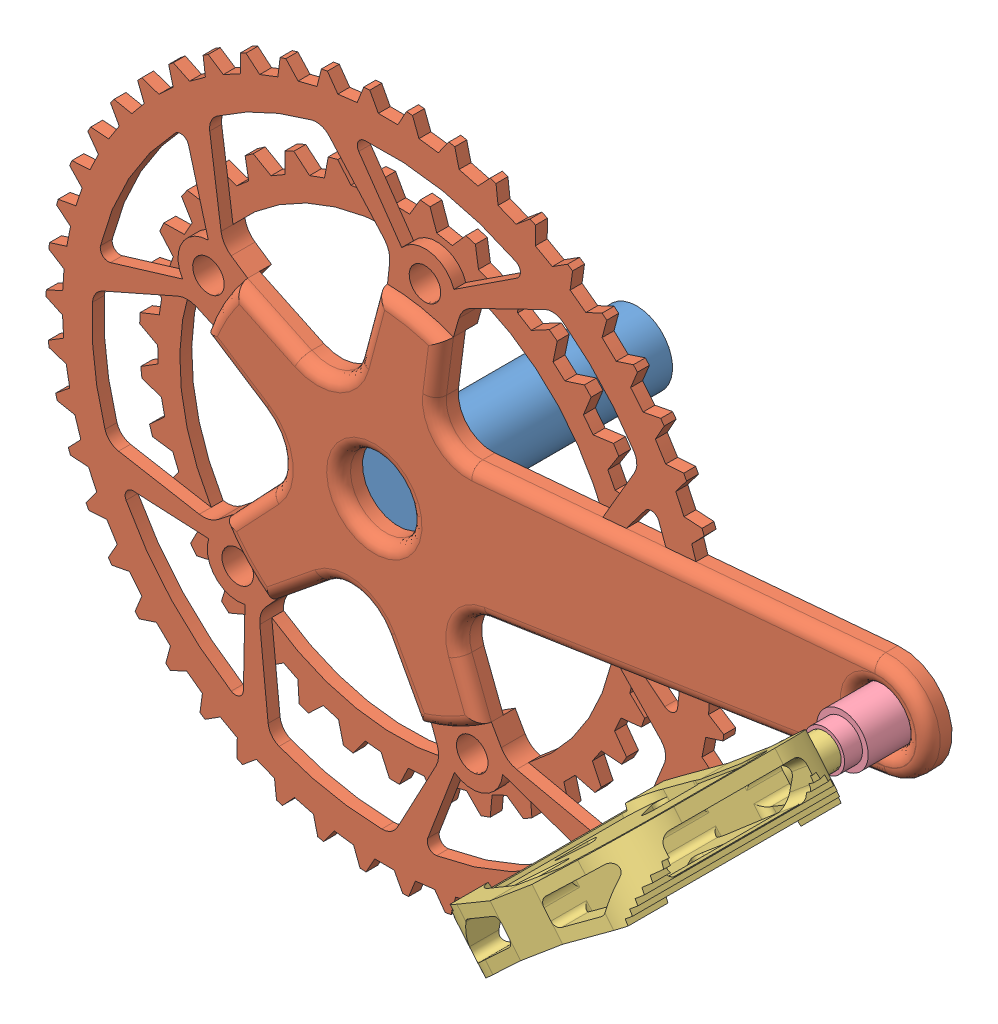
SolidWorks assembly Assem2.SLDASM, configuration Default (file format 9000). Lengths in mm.
Overall size (471.91 456.09 257.5).
4 component instances, 4 part files, 6 mates.
Components (placement in the parent):
- axis-1: axis.SLDPRT [Default] at (17.0409 103.1346 100) x (1 0 0) z (0 1 0) size (30 100 30)
- platos-1: platos.SLDPRT [Default] at (-136.3179 -292.7732 100) x (0.907185 0.420731 0) z (0.420731 -0.907185 0) size (365.67 15.38 333.16)
- DHB-057-1: DHB-057.SLDPRT [Default] at (218.6167 127.0555 207.5) x (0 0 -1) z (-0.766572 -0.642158 0) size (125 25.4 107.3)
- potenciometro-1: potenciometro.SLDPRT [Default] at (218.6167 127.0555 100) x (1 0 0) z (0 -1 0) size (21.6 32.5 21.6)
Mates (geometry in assembly coordinates):
- Coincident1: coincident anti-aligned: plane of axis-1 through (7.3866 101.5658 0) normal (0 0 -1); plane of assembly through (0 0 0) normal (0 0 1)
- Coincident4: coincident anti-aligned: circle of axis-1; circle of platos-1
- Concentric1: concentric anti-aligned: cylinder of platos-1 through (218.6167 127.0555 110) axis (0 0 -1) radius 10.8635; cylinder of DHB-057-1 through (218.6167 127.0555 157.5) axis (0 0 1) radius 7
- Coincident6: coincident anti-aligned: plane of DHB-057-1 through (218.6167 127.0555 132.5) normal (0 0 -1); plane of potenciometro-1 through (218.6167 127.0555 132.5) normal (0 0 1)
- Concentric2: concentric aligned: circle of DHB-057-1; circle of potenciometro-1
- Coincident10: coincident anti-aligned: plane of platos-1 through (7.3866 101.5658 100) normal (0 0 -1); circle of potenciometro-1
